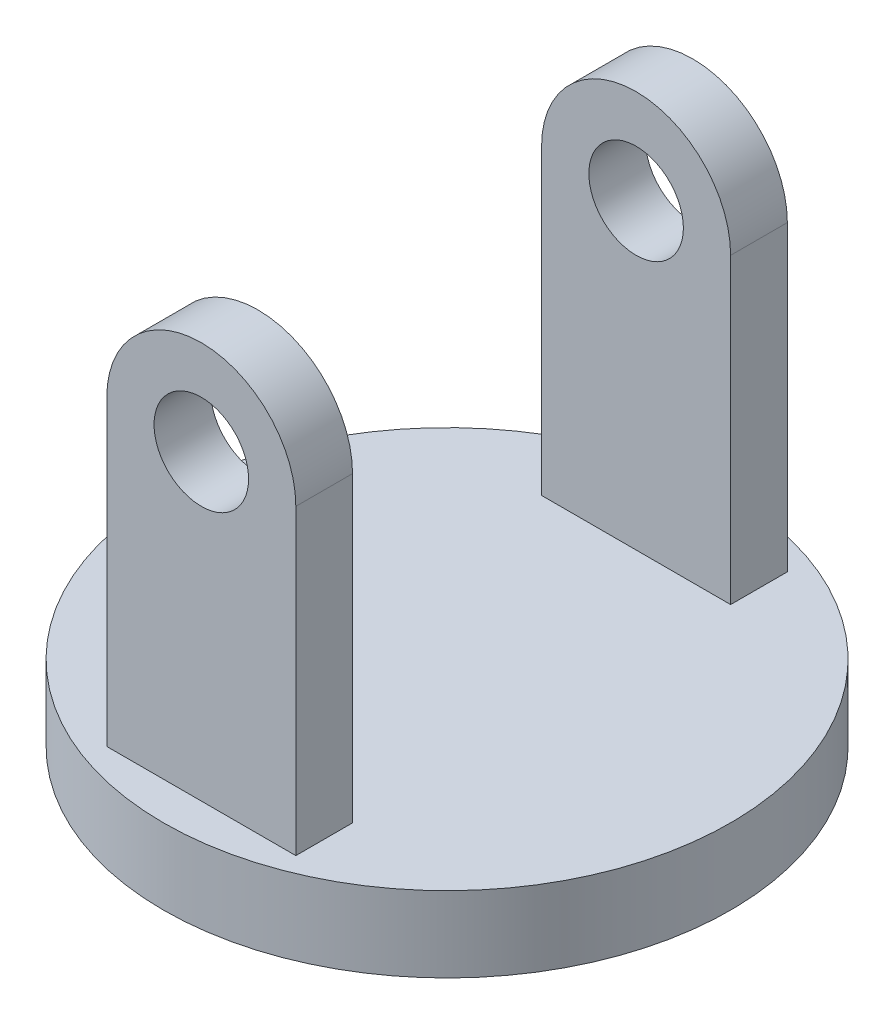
ISO-10303-21;
HEADER;
FILE_DESCRIPTION(('STEP AP214'),'2;1');
FILE_NAME('part.step','',(''),(''),'','','');
FILE_SCHEMA(('AUTOMOTIVE_DESIGN { 1 0 10303 214 1 1 1 1 }'));
ENDSEC;
DATA;
#1=APPLICATION_CONTEXT('core data for automotive mechanical design processes');
#2=APPLICATION_PROTOCOL_DEFINITION('international standard','automotive_design',2000,#1);
#3=PRODUCT_CONTEXT('',#1,'mechanical');
#4=PRODUCT('Part','Part','',(#3));
#5=PRODUCT_RELATED_PRODUCT_CATEGORY('part','',(#4));
#6=PRODUCT_DEFINITION_FORMATION('','',#4);
#7=PRODUCT_DEFINITION_CONTEXT('part definition',#1,'design');
#8=PRODUCT_DEFINITION('design','',#6,#7);
#9=PRODUCT_DEFINITION_SHAPE('','',#8);
#10=(LENGTH_UNIT() NAMED_UNIT(*) SI_UNIT(.MILLI.,.METRE.));
#11=(NAMED_UNIT(*) PLANE_ANGLE_UNIT() SI_UNIT($,.RADIAN.));
#12=(NAMED_UNIT(*) SI_UNIT($,.STERADIAN.) SOLID_ANGLE_UNIT());
#13=UNCERTAINTY_MEASURE_WITH_UNIT(LENGTH_MEASURE(1.E-05),#10,'distance_accuracy_value','');
#14=(GEOMETRIC_REPRESENTATION_CONTEXT(3) GLOBAL_UNCERTAINTY_ASSIGNED_CONTEXT((#13)) GLOBAL_UNIT_ASSIGNED_CONTEXT((#10,
#11,#12)) REPRESENTATION_CONTEXT('',''));
#15=CARTESIAN_POINT('',(0.,0.,0.));
#16=DIRECTION('',(0.,0.,1.));
#17=DIRECTION('',(1.,0.,0.));
#18=AXIS2_PLACEMENT_3D('',#15,#16,#17);
#19=CARTESIAN_POINT('',(0.,20.,0.));
#20=DIRECTION('',(0.,1.,0.));
#21=DIRECTION('',(0.,0.,1.));
#22=AXIS2_PLACEMENT_3D('',#19,#20,#21);
#23=PLANE('',#22);
#24=CARTESIAN_POINT('',(0.,20.,0.));
#25=DIRECTION('',(0.,1.,0.));
#26=DIRECTION('',(0.,0.,1.));
#27=AXIS2_PLACEMENT_3D('',#24,#25,#26);
#28=CIRCLE('',#27,75.);
#29=CARTESIAN_POINT('',(0.,20.,75.));
#30=VERTEX_POINT('',#29);
#31=EDGE_CURVE('E11',#30,#30,#28,.T.);
#32=ORIENTED_EDGE('',*,*,#31,.T.);
#33=EDGE_LOOP('',(#32));
#34=FACE_BOUND('',#33,.T.);
#35=DIRECTION('',(1.,0.,0.));
#36=VECTOR('',#35,1.);
#37=CARTESIAN_POINT('',(25.,20.,50.));
#38=LINE('',#37,#36);
#39=CARTESIAN_POINT('',(-25.,20.,50.));
#40=VERTEX_POINT('',#39);
#41=CARTESIAN_POINT('',(25.,20.,50.));
#42=VERTEX_POINT('',#41);
#43=EDGE_CURVE('E146',#40,#42,#38,.T.);
#44=ORIENTED_EDGE('',*,*,#43,.T.);
#45=DIRECTION('',(0.,0.,-1.));
#46=VECTOR('',#45,1.);
#47=CARTESIAN_POINT('',(25.,20.,65.));
#48=LINE('',#47,#46);
#49=CARTESIAN_POINT('',(25.,20.,65.));
#50=VERTEX_POINT('',#49);
#51=EDGE_CURVE('E152',#50,#42,#48,.T.);
#52=ORIENTED_EDGE('',*,*,#51,.F.);
#53=DIRECTION('',(1.,0.,0.));
#54=VECTOR('',#53,1.);
#55=CARTESIAN_POINT('',(25.,20.,65.));
#56=LINE('',#55,#54);
#57=CARTESIAN_POINT('',(-25.,20.,65.));
#58=VERTEX_POINT('',#57);
#59=EDGE_CURVE('E150',#58,#50,#56,.T.);
#60=ORIENTED_EDGE('',*,*,#59,.F.);
#61=DIRECTION('',(0.,0.,-1.));
#62=VECTOR('',#61,1.);
#63=CARTESIAN_POINT('',(-25.,20.,65.));
#64=LINE('',#63,#62);
#65=EDGE_CURVE('E163',#58,#40,#64,.T.);
#66=ORIENTED_EDGE('',*,*,#65,.T.);
#67=EDGE_LOOP('',(#44,#52,#60,#66));
#68=FACE_BOUND('',#67,.T.);
#69=DIRECTION('',(0.,0.,1.));
#70=VECTOR('',#69,1.);
#71=CARTESIAN_POINT('',(-25.,20.,-65.));
#72=LINE('',#71,#70);
#73=CARTESIAN_POINT('',(-25.,20.,-65.));
#74=VERTEX_POINT('',#73);
#75=CARTESIAN_POINT('',(-25.,20.,-50.));
#76=VERTEX_POINT('',#75);
#77=EDGE_CURVE('E54',#74,#76,#72,.T.);
#78=ORIENTED_EDGE('',*,*,#77,.F.);
#79=DIRECTION('',(1.,0.,0.));
#80=VECTOR('',#79,1.);
#81=CARTESIAN_POINT('',(25.,20.,-65.));
#82=LINE('',#81,#80);
#83=CARTESIAN_POINT('',(25.,20.,-65.));
#84=VERTEX_POINT('',#83);
#85=EDGE_CURVE('E49',#74,#84,#82,.T.);
#86=ORIENTED_EDGE('',*,*,#85,.T.);
#87=DIRECTION('',(0.,0.,1.));
#88=VECTOR('',#87,1.);
#89=CARTESIAN_POINT('',(25.,20.,-65.));
#90=LINE('',#89,#88);
#91=CARTESIAN_POINT('',(25.,20.,-50.));
#92=VERTEX_POINT('',#91);
#93=EDGE_CURVE('E133',#84,#92,#90,.T.);
#94=ORIENTED_EDGE('',*,*,#93,.T.);
#95=DIRECTION('',(1.,0.,0.));
#96=VECTOR('',#95,1.);
#97=CARTESIAN_POINT('',(25.,20.,-50.));
#98=LINE('',#97,#96);
#99=EDGE_CURVE('E124',#76,#92,#98,.T.);
#100=ORIENTED_EDGE('',*,*,#99,.F.);
#101=EDGE_LOOP('',(#78,#86,#94,#100));
#102=FACE_BOUND('',#101,.T.);
#103=ADVANCED_FACE('F34',(#34,#68,#102),#23,.T.);
#104=CARTESIAN_POINT('',(0.,20.,0.));
#105=DIRECTION('',(0.,-1.,0.));
#106=DIRECTION('',(0.,0.,-1.));
#107=AXIS2_PLACEMENT_3D('',#104,#105,#106);
#108=CYLINDRICAL_SURFACE('',#107,75.);
#109=ORIENTED_EDGE('',*,*,#31,.F.);
#110=EDGE_LOOP('',(#109));
#111=FACE_BOUND('',#110,.T.);
#112=CARTESIAN_POINT('',(0.,0.,0.));
#113=DIRECTION('',(0.,1.,0.));
#114=DIRECTION('',(0.,0.,1.));
#115=AXIS2_PLACEMENT_3D('',#112,#113,#114);
#116=CIRCLE('',#115,75.);
#117=CARTESIAN_POINT('',(0.,0.,75.));
#118=VERTEX_POINT('',#117);
#119=EDGE_CURVE('E38',#118,#118,#116,.T.);
#120=ORIENTED_EDGE('',*,*,#119,.T.);
#121=EDGE_LOOP('',(#120));
#122=FACE_BOUND('',#121,.T.);
#123=ADVANCED_FACE('F36',(#111,#122),#108,.T.);
#124=CARTESIAN_POINT('',(0.,0.,0.));
#125=DIRECTION('',(0.,1.,0.));
#126=DIRECTION('',(0.,0.,1.));
#127=AXIS2_PLACEMENT_3D('',#124,#125,#126);
#128=PLANE('',#127);
#129=ORIENTED_EDGE('',*,*,#119,.F.);
#130=EDGE_LOOP('',(#129));
#131=FACE_BOUND('',#130,.T.);
#132=ADVANCED_FACE('F177',(#131),#128,.F.);
#133=CARTESIAN_POINT('',(0.,100.,65.));
#134=DIRECTION('',(0.,0.,-1.));
#135=DIRECTION('',(-1.,0.,0.));
#136=AXIS2_PLACEMENT_3D('',#133,#134,#135);
#137=PLANE('',#136);
#138=DIRECTION('',(0.,1.,0.));
#139=VECTOR('',#138,1.);
#140=CARTESIAN_POINT('',(25.,20.,65.));
#141=LINE('',#140,#139);
#142=CARTESIAN_POINT('',(25.,100.,65.));
#143=VERTEX_POINT('',#142);
#144=EDGE_CURVE('E142',#50,#143,#141,.T.);
#145=ORIENTED_EDGE('',*,*,#144,.T.);
#146=CARTESIAN_POINT('',(0.,100.,65.));
#147=DIRECTION('',(0.,0.,1.));
#148=DIRECTION('',(-1.,0.,0.));
#149=AXIS2_PLACEMENT_3D('',#146,#147,#148);
#150=CIRCLE('',#149,25.);
#151=CARTESIAN_POINT('',(-25.,100.,65.));
#152=VERTEX_POINT('',#151);
#153=EDGE_CURVE('E145',#143,#152,#150,.T.);
#154=ORIENTED_EDGE('',*,*,#153,.T.);
#155=DIRECTION('',(0.,-1.,0.));
#156=VECTOR('',#155,1.);
#157=CARTESIAN_POINT('',(-25.,20.,65.));
#158=LINE('',#157,#156);
#159=EDGE_CURVE('E148',#152,#58,#158,.T.);
#160=ORIENTED_EDGE('',*,*,#159,.T.);
#161=ORIENTED_EDGE('',*,*,#59,.T.);
#162=EDGE_LOOP('',(#145,#154,#160,#161));
#163=FACE_BOUND('',#162,.T.);
#164=CARTESIAN_POINT('',(0.,100.,65.));
#165=DIRECTION('',(0.,0.,1.));
#166=DIRECTION('',(1.,0.,0.));
#167=AXIS2_PLACEMENT_3D('',#164,#165,#166);
#168=CIRCLE('',#167,12.5);
#169=CARTESIAN_POINT('',(12.5,100.,65.));
#170=VERTEX_POINT('',#169);
#171=EDGE_CURVE('E136',#170,#170,#168,.T.);
#172=ORIENTED_EDGE('',*,*,#171,.F.);
#173=EDGE_LOOP('',(#172));
#174=FACE_BOUND('',#173,.T.);
#175=ADVANCED_FACE('F179',(#163,#174),#137,.F.);
#176=CARTESIAN_POINT('',(0.,100.,50.));
#177=DIRECTION('',(0.,0.,-1.));
#178=DIRECTION('',(-1.,0.,0.));
#179=AXIS2_PLACEMENT_3D('',#176,#177,#178);
#180=PLANE('',#179);
#181=DIRECTION('',(0.,1.,0.));
#182=VECTOR('',#181,1.);
#183=CARTESIAN_POINT('',(25.,20.,50.));
#184=LINE('',#183,#182);
#185=CARTESIAN_POINT('',(25.,100.,50.));
#186=VERTEX_POINT('',#185);
#187=EDGE_CURVE('E139',#42,#186,#184,.T.);
#188=ORIENTED_EDGE('',*,*,#187,.F.);
#189=ORIENTED_EDGE('',*,*,#43,.F.);
#190=DIRECTION('',(0.,-1.,0.));
#191=VECTOR('',#190,1.);
#192=CARTESIAN_POINT('',(-25.,20.,50.));
#193=LINE('',#192,#191);
#194=CARTESIAN_POINT('',(-25.,100.,50.));
#195=VERTEX_POINT('',#194);
#196=EDGE_CURVE('E157',#195,#40,#193,.T.);
#197=ORIENTED_EDGE('',*,*,#196,.F.);
#198=CARTESIAN_POINT('',(0.,100.,50.));
#199=DIRECTION('',(0.,0.,1.));
#200=DIRECTION('',(-1.,0.,0.));
#201=AXIS2_PLACEMENT_3D('',#198,#199,#200);
#202=CIRCLE('',#201,25.);
#203=EDGE_CURVE('E155',#186,#195,#202,.T.);
#204=ORIENTED_EDGE('',*,*,#203,.F.);
#205=EDGE_LOOP('',(#188,#189,#197,#204));
#206=FACE_BOUND('',#205,.T.);
#207=CARTESIAN_POINT('',(0.,100.,50.));
#208=DIRECTION('',(0.,0.,1.));
#209=DIRECTION('',(1.,0.,0.));
#210=AXIS2_PLACEMENT_3D('',#207,#208,#209);
#211=CIRCLE('',#210,12.5);
#212=CARTESIAN_POINT('',(12.5,100.,50.));
#213=VERTEX_POINT('',#212);
#214=EDGE_CURVE('E135',#213,#213,#211,.T.);
#215=ORIENTED_EDGE('',*,*,#214,.T.);
#216=EDGE_LOOP('',(#215));
#217=FACE_BOUND('',#216,.T.);
#218=ADVANCED_FACE('F184',(#206,#217),#180,.T.);
#219=CARTESIAN_POINT('',(25.,20.,65.));
#220=DIRECTION('',(-1.,0.,0.));
#221=DIRECTION('',(0.,0.,1.));
#222=AXIS2_PLACEMENT_3D('',#219,#220,#221);
#223=PLANE('',#222);
#224=ORIENTED_EDGE('',*,*,#187,.T.);
#225=DIRECTION('',(0.,0.,-1.));
#226=VECTOR('',#225,1.);
#227=CARTESIAN_POINT('',(25.,100.,65.));
#228=LINE('',#227,#226);
#229=EDGE_CURVE('E169',#143,#186,#228,.T.);
#230=ORIENTED_EDGE('',*,*,#229,.F.);
#231=ORIENTED_EDGE('',*,*,#144,.F.);
#232=ORIENTED_EDGE('',*,*,#51,.T.);
#233=EDGE_LOOP('',(#224,#230,#231,#232));
#234=FACE_BOUND('',#233,.T.);
#235=ADVANCED_FACE('F195',(#234),#223,.F.);
#236=CARTESIAN_POINT('',(0.,100.,65.));
#237=DIRECTION('',(0.,0.,-1.));
#238=DIRECTION('',(-1.,0.,0.));
#239=AXIS2_PLACEMENT_3D('',#236,#237,#238);
#240=CYLINDRICAL_SURFACE('',#239,25.);
#241=ORIENTED_EDGE('',*,*,#203,.T.);
#242=DIRECTION('',(0.,0.,-1.));
#243=VECTOR('',#242,1.);
#244=CARTESIAN_POINT('',(-25.,100.,65.));
#245=LINE('',#244,#243);
#246=EDGE_CURVE('E166',#152,#195,#245,.T.);
#247=ORIENTED_EDGE('',*,*,#246,.F.);
#248=ORIENTED_EDGE('',*,*,#153,.F.);
#249=ORIENTED_EDGE('',*,*,#229,.T.);
#250=EDGE_LOOP('',(#241,#247,#248,#249));
#251=FACE_BOUND('',#250,.T.);
#252=ADVANCED_FACE('F198',(#251),#240,.T.);
#253=CARTESIAN_POINT('',(-25.,20.,65.));
#254=DIRECTION('',(1.,0.,0.));
#255=DIRECTION('',(0.,0.,-1.));
#256=AXIS2_PLACEMENT_3D('',#253,#254,#255);
#257=PLANE('',#256);
#258=ORIENTED_EDGE('',*,*,#196,.T.);
#259=ORIENTED_EDGE('',*,*,#65,.F.);
#260=ORIENTED_EDGE('',*,*,#159,.F.);
#261=ORIENTED_EDGE('',*,*,#246,.T.);
#262=EDGE_LOOP('',(#258,#259,#260,#261));
#263=FACE_BOUND('',#262,.T.);
#264=ADVANCED_FACE('F202',(#263),#257,.F.);
#265=CARTESIAN_POINT('',(0.,100.,65.));
#266=DIRECTION('',(0.,0.,-1.));
#267=DIRECTION('',(-1.,0.,0.));
#268=AXIS2_PLACEMENT_3D('',#265,#266,#267);
#269=CYLINDRICAL_SURFACE('',#268,12.5);
#270=ORIENTED_EDGE('',*,*,#171,.T.);
#271=EDGE_LOOP('',(#270));
#272=FACE_BOUND('',#271,.T.);
#273=ORIENTED_EDGE('',*,*,#214,.F.);
#274=EDGE_LOOP('',(#273));
#275=FACE_BOUND('',#274,.T.);
#276=ADVANCED_FACE('F205',(#272,#275),#269,.F.);
#277=CARTESIAN_POINT('',(25.,20.,-65.));
#278=DIRECTION('',(1.,0.,0.));
#279=DIRECTION('',(0.,0.,-1.));
#280=AXIS2_PLACEMENT_3D('',#277,#278,#279);
#281=PLANE('',#280);
#282=DIRECTION('',(0.,1.,0.));
#283=VECTOR('',#282,1.);
#284=CARTESIAN_POINT('',(25.,20.,-50.));
#285=LINE('',#284,#283);
#286=CARTESIAN_POINT('',(25.,100.,-50.));
#287=VERTEX_POINT('',#286);
#288=EDGE_CURVE('E121',#92,#287,#285,.T.);
#289=ORIENTED_EDGE('',*,*,#288,.F.);
#290=ORIENTED_EDGE('',*,*,#93,.F.);
#291=DIRECTION('',(0.,1.,0.));
#292=VECTOR('',#291,1.);
#293=CARTESIAN_POINT('',(25.,20.,-65.));
#294=LINE('',#293,#292);
#295=CARTESIAN_POINT('',(25.,100.,-65.));
#296=VERTEX_POINT('',#295);
#297=EDGE_CURVE('E130',#84,#296,#294,.T.);
#298=ORIENTED_EDGE('',*,*,#297,.T.);
#299=DIRECTION('',(0.,0.,1.));
#300=VECTOR('',#299,1.);
#301=CARTESIAN_POINT('',(25.,100.,-65.));
#302=LINE('',#301,#300);
#303=EDGE_CURVE('E107',#296,#287,#302,.T.);
#304=ORIENTED_EDGE('',*,*,#303,.T.);
#305=EDGE_LOOP('',(#289,#290,#298,#304));
#306=FACE_BOUND('',#305,.T.);
#307=ADVANCED_FACE('F212',(#306),#281,.T.);
#308=CARTESIAN_POINT('',(-25.,20.,-65.));
#309=DIRECTION('',(-1.,0.,0.));
#310=DIRECTION('',(0.,0.,1.));
#311=AXIS2_PLACEMENT_3D('',#308,#309,#310);
#312=PLANE('',#311);
#313=DIRECTION('',(0.,-1.,0.));
#314=VECTOR('',#313,1.);
#315=CARTESIAN_POINT('',(-25.,20.,-50.));
#316=LINE('',#315,#314);
#317=CARTESIAN_POINT('',(-25.,100.,-50.));
#318=VERTEX_POINT('',#317);
#319=EDGE_CURVE('E102',#318,#76,#316,.T.);
#320=ORIENTED_EDGE('',*,*,#319,.F.);
#321=DIRECTION('',(0.,0.,1.));
#322=VECTOR('',#321,1.);
#323=CARTESIAN_POINT('',(-25.,100.,-65.));
#324=LINE('',#323,#322);
#325=CARTESIAN_POINT('',(-25.,100.,-65.));
#326=VERTEX_POINT('',#325);
#327=EDGE_CURVE('E97',#326,#318,#324,.T.);
#328=ORIENTED_EDGE('',*,*,#327,.F.);
#329=DIRECTION('',(0.,-1.,0.));
#330=VECTOR('',#329,1.);
#331=CARTESIAN_POINT('',(-25.,20.,-65.));
#332=LINE('',#331,#330);
#333=EDGE_CURVE('E100',#326,#74,#332,.T.);
#334=ORIENTED_EDGE('',*,*,#333,.T.);
#335=ORIENTED_EDGE('',*,*,#77,.T.);
#336=EDGE_LOOP('',(#320,#328,#334,#335));
#337=FACE_BOUND('',#336,.T.);
#338=ADVANCED_FACE('F99',(#337),#312,.T.);
#339=CARTESIAN_POINT('',(0.,100.,-65.));
#340=DIRECTION('',(0.,0.,1.));
#341=DIRECTION('',(1.,0.,0.));
#342=AXIS2_PLACEMENT_3D('',#339,#340,#341);
#343=CYLINDRICAL_SURFACE('',#342,25.);
#344=CARTESIAN_POINT('',(0.,100.,-50.));
#345=DIRECTION('',(0.,0.,1.));
#346=DIRECTION('',(-1.,0.,0.));
#347=AXIS2_PLACEMENT_3D('',#344,#345,#346);
#348=CIRCLE('',#347,25.);
#349=EDGE_CURVE('E129',#287,#318,#348,.T.);
#350=ORIENTED_EDGE('',*,*,#349,.F.);
#351=ORIENTED_EDGE('',*,*,#303,.F.);
#352=CARTESIAN_POINT('',(0.,100.,-65.));
#353=DIRECTION('',(0.,0.,1.));
#354=DIRECTION('',(-1.,0.,0.));
#355=AXIS2_PLACEMENT_3D('',#352,#353,#354);
#356=CIRCLE('',#355,25.);
#357=EDGE_CURVE('E113',#296,#326,#356,.T.);
#358=ORIENTED_EDGE('',*,*,#357,.T.);
#359=ORIENTED_EDGE('',*,*,#327,.T.);
#360=EDGE_LOOP('',(#350,#351,#358,#359));
#361=FACE_BOUND('',#360,.T.);
#362=ADVANCED_FACE('F115',(#361),#343,.T.);
#363=CARTESIAN_POINT('',(0.,100.,-65.));
#364=DIRECTION('',(0.,0.,1.));
#365=DIRECTION('',(-1.,0.,0.));
#366=AXIS2_PLACEMENT_3D('',#363,#364,#365);
#367=PLANE('',#366);
#368=CARTESIAN_POINT('',(0.,100.,-65.));
#369=DIRECTION('',(0.,0.,1.));
#370=DIRECTION('',(1.,0.,0.));
#371=AXIS2_PLACEMENT_3D('',#368,#369,#370);
#372=CIRCLE('',#371,12.5);
#373=CARTESIAN_POINT('',(12.5,100.,-65.));
#374=VERTEX_POINT('',#373);
#375=EDGE_CURVE('E125',#374,#374,#372,.T.);
#376=ORIENTED_EDGE('',*,*,#375,.T.);
#377=EDGE_LOOP('',(#376));
#378=FACE_BOUND('',#377,.T.);
#379=ORIENTED_EDGE('',*,*,#297,.F.);
#380=ORIENTED_EDGE('',*,*,#85,.F.);
#381=ORIENTED_EDGE('',*,*,#333,.F.);
#382=ORIENTED_EDGE('',*,*,#357,.F.);
#383=EDGE_LOOP('',(#379,#380,#381,#382));
#384=FACE_BOUND('',#383,.T.);
#385=ADVANCED_FACE('F112',(#378,#384),#367,.F.);
#386=CARTESIAN_POINT('',(0.,100.,-50.));
#387=DIRECTION('',(0.,0.,1.));
#388=DIRECTION('',(-1.,0.,0.));
#389=AXIS2_PLACEMENT_3D('',#386,#387,#388);
#390=PLANE('',#389);
#391=CARTESIAN_POINT('',(0.,100.,-50.));
#392=DIRECTION('',(0.,0.,1.));
#393=DIRECTION('',(1.,0.,0.));
#394=AXIS2_PLACEMENT_3D('',#391,#392,#393);
#395=CIRCLE('',#394,12.5);
#396=CARTESIAN_POINT('',(12.5,100.,-50.));
#397=VERTEX_POINT('',#396);
#398=EDGE_CURVE('E238',#397,#397,#395,.T.);
#399=ORIENTED_EDGE('',*,*,#398,.F.);
#400=EDGE_LOOP('',(#399));
#401=FACE_BOUND('',#400,.T.);
#402=ORIENTED_EDGE('',*,*,#288,.T.);
#403=ORIENTED_EDGE('',*,*,#349,.T.);
#404=ORIENTED_EDGE('',*,*,#319,.T.);
#405=ORIENTED_EDGE('',*,*,#99,.T.);
#406=EDGE_LOOP('',(#402,#403,#404,#405));
#407=FACE_BOUND('',#406,.T.);
#408=ADVANCED_FACE('F221',(#401,#407),#390,.T.);
#409=CARTESIAN_POINT('',(0.,100.,-65.));
#410=DIRECTION('',(0.,0.,1.));
#411=DIRECTION('',(1.,0.,0.));
#412=AXIS2_PLACEMENT_3D('',#409,#410,#411);
#413=CYLINDRICAL_SURFACE('',#412,12.5);
#414=ORIENTED_EDGE('',*,*,#375,.F.);
#415=EDGE_LOOP('',(#414));
#416=FACE_BOUND('',#415,.T.);
#417=ORIENTED_EDGE('',*,*,#398,.T.);
#418=EDGE_LOOP('',(#417));
#419=FACE_BOUND('',#418,.T.);
#420=ADVANCED_FACE('F224',(#416,#419),#413,.F.);
#421=CLOSED_SHELL('',(#103,#123,#132,#175,#218,#235,#252,#264,#276,#307,#338,#362,#385,#408,#420));
#422=MANIFOLD_SOLID_BREP('B2',#421);
#423=ADVANCED_BREP_SHAPE_REPRESENTATION('',(#18,#422),#14);
#424=SHAPE_DEFINITION_REPRESENTATION(#9,#423);
ENDSEC;
END-ISO-10303-21;
